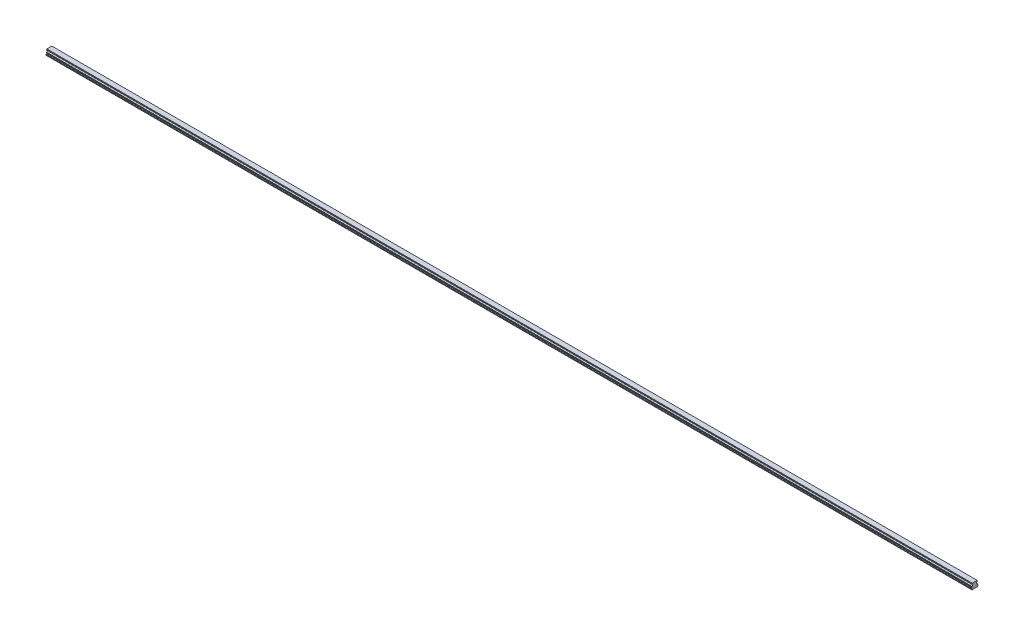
from build123d import *

# Parameters (mm, degrees)
BOSS_EXTRUDE1_DEPTH        = 3480
SKETCH3_R                  = 3
SKETCH3_R_2                = 2.5
CUT_EXTRUDE3_DEPTH         = 12
SKETCH3_2_R                = 2.5
CUT_EXTRUDE4_DEPTH         = 15
CHAMFER1_SIZE              = 0.5
LPATTERN4_COUNT            = 58
LPATTERN4_PITCH            = 60
CHAMFER1_OF_LPATTERN4_SIZE = 0.5


with BuildPart() as part:
    # Sketch1 → Boss-Extrude1 (new body)
    with BuildSketch(Plane(origin=(0, 0, 0), x_dir=(0, 0, -1), z_dir=(1, 0, 0))):
        with BuildLine():
            Line((9.375, 21.8), (-9.375, 21.8))
            Line((-9.375, 21.8), (-9.375, 20.756))
            Line((-9.375, 20.756), (-10, 19.415683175))
            Line((-10, 19.415683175), (-10, 17.685449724))
            ThreePointArc((-10, 17.685449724), (-7.2, 14.6), (-10, 11.514550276))
            Line((-10, 11.514550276), (-10, 9.784316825))
            Line((-10, 9.784316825), (-9.375, 8.444))
            Line((-9.375, 8.444), (-9.922688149, 6.4))
            Line((-9.922688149, 6.4), (-12.5, 5.489338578))
            Line((-12.5, 5.489338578), (-12.5, 2.65))
            Line((-12.5, 2.65), (-9.85, 0))
            Line((-9.85, 0), (-5.5, 0))
            Line((-5.5, 0), (-5, 0.5))
            Line((-5, 0.5), (5, 0.5))
            Line((5, 0.5), (5.5, 0))
            Line((5.5, 0), (9.85, 0))
            Line((9.85, 0), (12.5, 2.65))
            Line((12.5, 2.65), (12.5, 5.489338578))
            Line((12.5, 5.489338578), (9.922688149, 6.4))
            Line((9.922688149, 6.4), (9.375, 8.444))
            Line((9.375, 8.444), (10, 9.784316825))
            Line((10, 9.784316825), (10, 11.514550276))
            ThreePointArc((10, 11.514550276), (7.2, 14.6), (10, 17.685449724))
            Line((10, 17.685449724), (10, 19.415683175))
            Line((10, 19.415683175), (9.375, 20.756))
            Line((9.375, 20.756), (9.375, 21.8))
        make_face()
    extrude(amount=BOSS_EXTRUDE1_DEPTH)

    # Sketch3 → Cut-Extrude3 (cut)
    with BuildSketch(Plane.XZ):
        with Locations(Location((30, 0, 0), (0, 0, 270))):
            Circle(SKETCH3_R)
        with Locations(Location((30, 0, 0), (0, 0, 270))):
            Circle(SKETCH3_R_2, mode=Mode.SUBTRACT)
    cut_extrude3 = extrude(amount=-CUT_EXTRUDE3_DEPTH, mode=Mode.SUBTRACT)

    # Sketch3_2 → Cut-Extrude4 (cut)
    with BuildSketch(Plane.XZ):
        with Locations(Location((30, 0, 0), (0, 0, 270))):
            Circle(SKETCH3_2_R)
    cut_extrude4 = extrude(amount=-CUT_EXTRUDE4_DEPTH, mode=Mode.SUBTRACT)

    # Cut-Extrude5 cone 1 section (on through the dimple's axis) → Cut-Extrude5 (revolve, cut)
    with BuildSketch(Plane(origin=(30, 15, 0), x_dir=(0, 0, -1), z_dir=(1, 0, 0))):
        Polygon((0, 0), (2.5, 0), (0, 1.443375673), align=None)
    cut_extrude5 = revolve(axis=Axis((30, 15, 0), (0, 1, 0)), mode=Mode.SUBTRACT)

    # Chamfer1
    chamfer1_edges = [part.edges().sort_by_distance(p)[0] for p in [
        (30, 0.5, 3),
    ]]
    chamfer(chamfer1_edges, length=CHAMFER1_SIZE)

    # LPattern4: Cut-Extrude3, Cut-Extrude4, Cut-Extrude5 ×58
    with Locations(*[(i * LPATTERN4_PITCH, 0, 0) for i in range(1, LPATTERN4_COUNT)]):
        add(cut_extrude3, mode=Mode.SUBTRACT)
        add(cut_extrude4, mode=Mode.SUBTRACT)
        add(cut_extrude5, mode=Mode.SUBTRACT)

    # Chamfer1 of LPattern4
    chamfer1_of_lpattern4_edges = [part.edges().sort_by_distance(p)[0] for p in [
        (90, 0.5, 3),
        (150, 0.5, 3),
        (210, 0.5, 3),
        (270, 0.5, 3),
        (330, 0.5, 3),
        (390, 0.5, 3),
        (450, 0.5, 3),
        (510, 0.5, 3),
        (570, 0.5, 3),
        (630, 0.5, 3),
        (690, 0.5, 3),
        (750, 0.5, 3),
        (810, 0.5, 3),
        (870, 0.5, 3),
        (930, 0.5, 3),
        (990, 0.5, 3),
        (1050, 0.5, 3),
        (1110, 0.5, 3),
        (1170, 0.5, 3),
        (1230, 0.5, 3),
        (1290, 0.5, 3),
        (1350, 0.5, 3),
        (1410, 0.5, 3),
        (1470, 0.5, 3),
        (1530, 0.5, 3),
        (1590, 0.5, 3),
        (1650, 0.5, 3),
        (1710, 0.5, 3),
        (1770, 0.5, 3),
        (1830, 0.5, 3),
        (1890, 0.5, 3),
        (1950, 0.5, 3),
        (2010, 0.5, 3),
        (2070, 0.5, 3),
        (2130, 0.5, 3),
        (2190, 0.5, 3),
        (2250, 0.5, 3),
        (2310, 0.5, 3),
        (2370, 0.5, 3),
        (2430, 0.5, 3),
        (2490, 0.5, 3),
        (2550, 0.5, 3),
        (2610, 0.5, 3),
        (2670, 0.5, 3),
        (2730, 0.5, 3),
        (2790, 0.5, 3),
        (2850, 0.5, 3),
        (2910, 0.5, 3),
        (2970, 0.5, 3),
        (3030, 0.5, 3),
        (3090, 0.5, 3),
        (3150, 0.5, 3),
        (3210, 0.5, 3),
        (3270, 0.5, 3),
        (3330, 0.5, 3),
        (3390, 0.5, 3),
        (3450, 0.5, 3),
    ]]
    chamfer(chamfer1_of_lpattern4_edges, length=CHAMFER1_OF_LPATTERN4_SIZE)


solid = part.part
